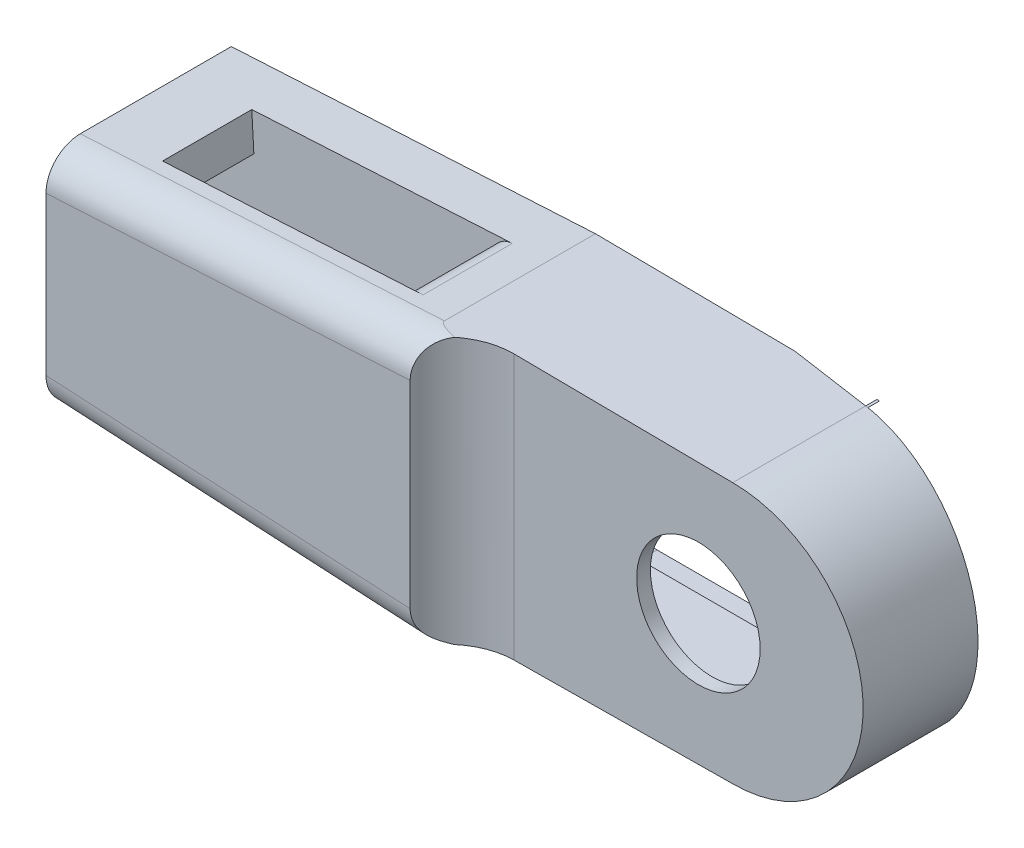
ISO-10303-21;
HEADER;
FILE_DESCRIPTION(('STEP AP214'),'2;1');
FILE_NAME('part.step','',(''),(''),'','','');
FILE_SCHEMA(('AUTOMOTIVE_DESIGN { 1 0 10303 214 1 1 1 1 }'));
ENDSEC;
DATA;
#1=APPLICATION_CONTEXT('core data for automotive mechanical design processes');
#2=APPLICATION_PROTOCOL_DEFINITION('international standard','automotive_design',2000,#1);
#3=PRODUCT_CONTEXT('',#1,'mechanical');
#4=PRODUCT('Part','Part','',(#3));
#5=PRODUCT_RELATED_PRODUCT_CATEGORY('part','',(#4));
#6=PRODUCT_DEFINITION_FORMATION('','',#4);
#7=PRODUCT_DEFINITION_CONTEXT('part definition',#1,'design');
#8=PRODUCT_DEFINITION('design','',#6,#7);
#9=PRODUCT_DEFINITION_SHAPE('','',#8);
#10=(LENGTH_UNIT() NAMED_UNIT(*) SI_UNIT(.MILLI.,.METRE.));
#11=(NAMED_UNIT(*) PLANE_ANGLE_UNIT() SI_UNIT($,.RADIAN.));
#12=(NAMED_UNIT(*) SI_UNIT($,.STERADIAN.) SOLID_ANGLE_UNIT());
#13=UNCERTAINTY_MEASURE_WITH_UNIT(LENGTH_MEASURE(1.E-05),#10,'distance_accuracy_value','');
#14=(GEOMETRIC_REPRESENTATION_CONTEXT(3) GLOBAL_UNCERTAINTY_ASSIGNED_CONTEXT((#13)) GLOBAL_UNIT_ASSIGNED_CONTEXT((#10,
#11,#12)) REPRESENTATION_CONTEXT('',''));
#15=CARTESIAN_POINT('',(0.,0.,0.));
#16=DIRECTION('',(0.,0.,1.));
#17=DIRECTION('',(1.,0.,0.));
#18=AXIS2_PLACEMENT_3D('',#15,#16,#17);
#19=CARTESIAN_POINT('',(36.,0.,-27.));
#20=DIRECTION('',(0.,0.,1.));
#21=DIRECTION('',(1.,0.,0.));
#22=AXIS2_PLACEMENT_3D('',#19,#20,#21);
#23=CYLINDRICAL_SURFACE('',#22,9.);
#24=CARTESIAN_POINT('',(36.,0.,-6.));
#25=DIRECTION('',(0.,0.,1.));
#26=DIRECTION('',(1.,0.,0.));
#27=AXIS2_PLACEMENT_3D('',#24,#25,#26);
#28=CIRCLE('',#27,9.);
#29=CARTESIAN_POINT('',(45.,0.,-6.));
#30=VERTEX_POINT('',#29);
#31=EDGE_CURVE('E316',#30,#30,#28,.F.);
#32=ORIENTED_EDGE('',*,*,#31,.F.);
#33=EDGE_LOOP('',(#32));
#34=FACE_BOUND('',#33,.T.);
#35=CARTESIAN_POINT('',(36.,0.,-8.));
#36=DIRECTION('',(0.,0.,-1.));
#37=DIRECTION('',(-1.,0.,0.));
#38=AXIS2_PLACEMENT_3D('',#35,#36,#37);
#39=CIRCLE('',#38,9.);
#40=CARTESIAN_POINT('',(27.,0.,-8.));
#41=VERTEX_POINT('',#40);
#42=EDGE_CURVE('E559',#41,#41,#39,.F.);
#43=ORIENTED_EDGE('',*,*,#42,.F.);
#44=EDGE_LOOP('',(#43));
#45=FACE_BOUND('',#44,.T.);
#46=ADVANCED_FACE('F45',(#34,#45),#23,.F.);
#47=CARTESIAN_POINT('',(-38.5737420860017,-64.8291949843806,-7.));
#48=DIRECTION('',(-0.998498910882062,-0.0547715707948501,0.));
#49=DIRECTION('',(0.0547715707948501,-0.998498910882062,0.));
#50=AXIS2_PLACEMENT_3D('',#47,#48,#49);
#51=PLANE('',#50);
#52=DIRECTION('',(-0.0547715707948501,0.998498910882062,0.));
#53=VECTOR('',#52,1.);
#54=CARTESIAN_POINT('',(-38.5737420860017,-64.8291949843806,-7.));
#55=LINE('',#54,#53);
#56=CARTESIAN_POINT('',(-42.7665058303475,11.6058966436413,-7.));
#57=VERTEX_POINT('',#56);
#58=CARTESIAN_POINT('',(-43.0650108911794,17.0477157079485,-7.));
#59=VERTEX_POINT('',#58);
#60=EDGE_CURVE('E706',#57,#59,#55,.T.);
#61=ORIENTED_EDGE('',*,*,#60,.F.);
#62=DIRECTION('',(0.,0.,1.));
#63=VECTOR('',#62,1.);
#64=CARTESIAN_POINT('',(-42.7665058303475,11.6058966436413,-7.));
#65=LINE('',#64,#63);
#66=CARTESIAN_POINT('',(-42.7665058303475,11.6058966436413,-20.));
#67=VERTEX_POINT('',#66);
#68=EDGE_CURVE('E680',#67,#57,#65,.T.);
#69=ORIENTED_EDGE('',*,*,#68,.F.);
#70=DIRECTION('',(-0.0547715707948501,0.998498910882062,0.));
#71=VECTOR('',#70,1.);
#72=CARTESIAN_POINT('',(-38.5737420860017,-64.8291949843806,-20.));
#73=LINE('',#72,#71);
#74=CARTESIAN_POINT('',(-43.0650108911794,17.0477157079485,-20.));
#75=VERTEX_POINT('',#74);
#76=EDGE_CURVE('E711',#67,#75,#73,.T.);
#77=ORIENTED_EDGE('',*,*,#76,.T.);
#78=DIRECTION('',(0.,0.,1.));
#79=VECTOR('',#78,1.);
#80=CARTESIAN_POINT('',(-43.0650108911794,17.0477157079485,-7.));
#81=LINE('',#80,#79);
#82=EDGE_CURVE('E687',#75,#59,#81,.T.);
#83=ORIENTED_EDGE('',*,*,#82,.T.);
#84=EDGE_LOOP('',(#61,#69,#77,#83));
#85=FACE_BOUND('',#84,.T.);
#86=ADVANCED_FACE('F470',(#85),#51,.F.);
#87=CARTESIAN_POINT('',(0.,19.41,-27.));
#88=DIRECTION('',(0.00999950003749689,0.999950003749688,0.));
#89=DIRECTION('',(-0.999950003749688,0.00999950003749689,0.));
#90=AXIS2_PLACEMENT_3D('',#87,#88,#89);
#91=PLANE('',#90);
#92=DIRECTION('',(0.99070275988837,-0.00990702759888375,0.135683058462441));
#93=VECTOR('',#92,1.);
#94=CARTESIAN_POINT('',(29.0640159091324,19.1193598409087,-27.));
#95=LINE('',#94,#93);
#96=CARTESIAN_POINT('',(29.0640159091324,19.1193598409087,-27.));
#97=VERTEX_POINT('',#96);
#98=CARTESIAN_POINT('',(40.9999999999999,19.,-25.3652908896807));
#99=VERTEX_POINT('',#98);
#100=EDGE_CURVE('E272',#97,#99,#95,.T.);
#101=ORIENTED_EDGE('',*,*,#100,.F.);
#102=DIRECTION('',(-0.999950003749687,0.00999950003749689,0.));
#103=VECTOR('',#102,1.);
#104=CARTESIAN_POINT('',(0.,19.41,-27.));
#105=LINE('',#104,#103);
#106=CARTESIAN_POINT('',(0.,19.41,-27.));
#107=VERTEX_POINT('',#106);
#108=EDGE_CURVE('E285',#97,#107,#105,.T.);
#109=ORIENTED_EDGE('',*,*,#108,.T.);
#110=DIRECTION('',(0.,0.,1.));
#111=VECTOR('',#110,1.);
#112=CARTESIAN_POINT('',(0.,19.41,-27.));
#113=LINE('',#112,#111);
#114=CARTESIAN_POINT('',(0.,19.41,-5.));
#115=VERTEX_POINT('',#114);
#116=EDGE_CURVE('E317',#107,#115,#113,.T.);
#117=ORIENTED_EDGE('',*,*,#116,.T.);
#118=CARTESIAN_POINT('',(77.2122547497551,18.6378774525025,-5.));
#119=DIRECTION('',(0.00999950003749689,0.999950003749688,0.));
#120=DIRECTION('',(-0.999950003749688,0.00999950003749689,0.));
#121=AXIS2_PLACEMENT_3D('',#118,#119,#120);
#122=ELLIPSE('',#121,77.216115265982,5.);
#123=CARTESIAN_POINT('',(2.75593846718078,19.3824406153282,-3.6760660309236));
#124=VERTEX_POINT('',#123);
#125=EDGE_CURVE('E580',#115,#124,#122,.T.);
#126=ORIENTED_EDGE('',*,*,#125,.T.);
#127=CARTESIAN_POINT('',(9.16515138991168,19.3183484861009,4.));
#128=DIRECTION('',(0.00999950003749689,0.999950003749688,0.));
#129=DIRECTION('',(-0.999950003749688,0.00999950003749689,0.));
#130=AXIS2_PLACEMENT_3D('',#127,#128,#129);
#131=ELLIPSE('',#130,10.0004999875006,10.);
#132=CARTESIAN_POINT('',(9.16515138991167,19.3183484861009,-6.));
#133=VERTEX_POINT('',#132);
#134=EDGE_CURVE('E598',#124,#133,#131,.F.);
#135=ORIENTED_EDGE('',*,*,#134,.T.);
#136=DIRECTION('',(-0.999950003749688,0.00999950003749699,0.));
#137=VECTOR('',#136,1.);
#138=CARTESIAN_POINT('',(40.9999999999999,19.,-6.));
#139=LINE('',#138,#137);
#140=CARTESIAN_POINT('',(40.9999999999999,19.,-6.));
#141=VERTEX_POINT('',#140);
#142=EDGE_CURVE('E727',#141,#133,#139,.T.);
#143=ORIENTED_EDGE('',*,*,#142,.F.);
#144=DIRECTION('',(0.,0.,1.));
#145=VECTOR('',#144,1.);
#146=CARTESIAN_POINT('',(41.,19.,-27.));
#147=LINE('',#146,#145);
#148=EDGE_CURVE('E288',#99,#141,#147,.T.);
#149=ORIENTED_EDGE('',*,*,#148,.F.);
#150=EDGE_LOOP('',(#101,#109,#117,#126,#135,#143,#149));
#151=FACE_BOUND('',#150,.T.);
#152=ADVANCED_FACE('F283',(#151),#91,.T.);
#153=CARTESIAN_POINT('',(41.,0.,-27.));
#154=DIRECTION('',(0.,0.,1.));
#155=DIRECTION('',(1.,0.,0.));
#156=AXIS2_PLACEMENT_3D('',#153,#154,#155);
#157=CYLINDRICAL_SURFACE('',#156,19.);
#158=CARTESIAN_POINT('',(41.,0.,-25.3392717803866));
#159=DIRECTION('',(-0.135676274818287,0.00135676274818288,0.990752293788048));
#160=DIRECTION('',(0.99070275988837,-0.00990702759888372,0.135683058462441));
#161=AXIS2_PLACEMENT_3D('',#158,#159,#160);
#162=ELLIPSE('',#161,19.1773464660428,19.);
#163=CARTESIAN_POINT('',(41.3799620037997,18.996200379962,-25.3132526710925));
#164=VERTEX_POINT('',#163);
#165=CARTESIAN_POINT('',(41.0000000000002,-19.,-25.3132526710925));
#166=VERTEX_POINT('',#165);
#167=EDGE_CURVE('E903',#164,#166,#162,.F.);
#168=ORIENTED_EDGE('',*,*,#167,.F.);
#169=DIRECTION('',(0.,0.,1.));
#170=VECTOR('',#169,1.);
#171=CARTESIAN_POINT('',(41.3799620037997,18.996200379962,-27.));
#172=LINE('',#171,#170);
#173=CARTESIAN_POINT('',(41.3799620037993,18.996200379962,-27.));
#174=VERTEX_POINT('',#173);
#175=EDGE_CURVE('E335',#164,#174,#172,.F.);
#176=ORIENTED_EDGE('',*,*,#175,.T.);
#177=CARTESIAN_POINT('',(41.,0.,-27.));
#178=DIRECTION('',(0.,0.,1.));
#179=DIRECTION('',(0.019998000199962,0.999800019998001,0.));
#180=AXIS2_PLACEMENT_3D('',#177,#178,#179);
#181=CIRCLE('',#180,19.);
#182=CARTESIAN_POINT('',(41.,19.,-27.));
#183=VERTEX_POINT('',#182);
#184=EDGE_CURVE('E11',#174,#183,#181,.T.);
#185=ORIENTED_EDGE('',*,*,#184,.T.);
#186=EDGE_CURVE('E321',#183,#99,#147,.T.);
#187=ORIENTED_EDGE('',*,*,#186,.T.);
#188=ORIENTED_EDGE('',*,*,#148,.T.);
#189=CARTESIAN_POINT('',(41.,0.,-6.));
#190=DIRECTION('',(0.,0.,1.));
#191=DIRECTION('',(1.,0.,0.));
#192=AXIS2_PLACEMENT_3D('',#189,#190,#191);
#193=CIRCLE('',#192,19.);
#194=CARTESIAN_POINT('',(41.0000000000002,-19.,-6.));
#195=VERTEX_POINT('',#194);
#196=EDGE_CURVE('E723',#195,#141,#193,.T.);
#197=ORIENTED_EDGE('',*,*,#196,.F.);
#198=DIRECTION('',(0.,0.,1.));
#199=VECTOR('',#198,1.);
#200=CARTESIAN_POINT('',(41.,-19.,-27.));
#201=LINE('',#200,#199);
#202=EDGE_CURVE('E325',#166,#195,#201,.T.);
#203=ORIENTED_EDGE('',*,*,#202,.F.);
#204=EDGE_LOOP('',(#168,#176,#185,#187,#188,#197,#203));
#205=FACE_BOUND('',#204,.T.);
#206=ADVANCED_FACE('F334',(#205),#157,.T.);
#207=CARTESIAN_POINT('',(0.,-19.41,-27.));
#208=DIRECTION('',(0.00999950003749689,-0.999950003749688,0.));
#209=DIRECTION('',(0.999950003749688,0.00999950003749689,0.));
#210=AXIS2_PLACEMENT_3D('',#207,#208,#209);
#211=PLANE('',#210);
#212=DIRECTION('',(-0.990706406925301,-0.00990706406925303,-0.135656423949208));
#213=VECTOR('',#212,1.);
#214=CARTESIAN_POINT('',(0.527817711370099,-19.4047218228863,-30.8550675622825));
#215=LINE('',#214,#213);
#216=CARTESIAN_POINT('',(28.6815904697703,-19.1231840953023,-27.));
#217=VERTEX_POINT('',#216);
#218=EDGE_CURVE('E905',#166,#217,#215,.T.);
#219=ORIENTED_EDGE('',*,*,#218,.F.);
#220=ORIENTED_EDGE('',*,*,#202,.T.);
#221=DIRECTION('',(0.999950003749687,0.00999950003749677,0.));
#222=VECTOR('',#221,1.);
#223=CARTESIAN_POINT('',(-6.24458709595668E-13,-19.41,-6.));
#224=LINE('',#223,#222);
#225=CARTESIAN_POINT('',(9.16515138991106,-19.3183484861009,-6.));
#226=VERTEX_POINT('',#225);
#227=EDGE_CURVE('E596',#226,#195,#224,.T.);
#228=ORIENTED_EDGE('',*,*,#227,.F.);
#229=CARTESIAN_POINT('',(9.16515138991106,-19.3183484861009,4.));
#230=DIRECTION('',(0.00999950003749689,-0.999950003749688,0.));
#231=DIRECTION('',(0.999950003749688,0.00999950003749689,0.));
#232=AXIS2_PLACEMENT_3D('',#229,#230,#231);
#233=ELLIPSE('',#232,10.0004999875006,10.);
#234=CARTESIAN_POINT('',(2.75593846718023,-19.3824406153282,-3.67606603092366));
#235=VERTEX_POINT('',#234);
#236=EDGE_CURVE('E587',#226,#235,#233,.F.);
#237=ORIENTED_EDGE('',*,*,#236,.T.);
#238=CARTESIAN_POINT('',(77.2122547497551,-18.6378774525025,-5.));
#239=DIRECTION('',(0.00999950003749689,-0.999950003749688,0.));
#240=DIRECTION('',(0.999950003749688,0.00999950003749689,0.));
#241=AXIS2_PLACEMENT_3D('',#238,#239,#240);
#242=ELLIPSE('',#241,77.216115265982,5.);
#243=CARTESIAN_POINT('',(0.,-19.41,-5.));
#244=VERTEX_POINT('',#243);
#245=EDGE_CURVE('E73',#235,#244,#242,.T.);
#246=ORIENTED_EDGE('',*,*,#245,.T.);
#247=DIRECTION('',(0.,0.,1.));
#248=VECTOR('',#247,1.);
#249=CARTESIAN_POINT('',(0.,-19.41,-27.));
#250=LINE('',#249,#248);
#251=CARTESIAN_POINT('',(0.,-19.41,-27.));
#252=VERTEX_POINT('',#251);
#253=EDGE_CURVE('E743',#252,#244,#250,.T.);
#254=ORIENTED_EDGE('',*,*,#253,.F.);
#255=DIRECTION('',(0.999950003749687,0.00999950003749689,0.));
#256=VECTOR('',#255,1.);
#257=CARTESIAN_POINT('',(0.,-19.41,-27.));
#258=LINE('',#257,#256);
#259=EDGE_CURVE('E300',#252,#217,#258,.T.);
#260=ORIENTED_EDGE('',*,*,#259,.T.);
#261=EDGE_LOOP('',(#219,#220,#228,#237,#246,#254,#260));
#262=FACE_BOUND('',#261,.T.);
#263=ADVANCED_FACE('F489',(#262),#211,.T.);
#264=CARTESIAN_POINT('',(-53.05,16.5,-27.));
#265=DIRECTION('',(-0.0547715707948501,0.998498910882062,0.));
#266=DIRECTION('',(-0.998498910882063,-0.0547715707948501,0.));
#267=AXIS2_PLACEMENT_3D('',#264,#265,#266);
#268=PLANE('',#267);
#269=DIRECTION('',(-0.998498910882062,-0.0547715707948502,0.));
#270=VECTOR('',#269,1.);
#271=CARTESIAN_POINT('',(-43.0650108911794,17.0477157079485,-20.));
#272=LINE('',#271,#270);
#273=CARTESIAN_POINT('',(-5.12205227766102,19.1290353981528,-20.));
#274=VERTEX_POINT('',#273);
#275=EDGE_CURVE('E702',#274,#75,#272,.T.);
#276=ORIENTED_EDGE('',*,*,#275,.F.);
#277=DIRECTION('',(0.,0.,-1.));
#278=VECTOR('',#277,1.);
#279=CARTESIAN_POINT('',(-5.12205227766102,19.1290353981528,-7.));
#280=LINE('',#279,#278);
#281=CARTESIAN_POINT('',(-5.12205227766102,19.1290353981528,-7.));
#282=VERTEX_POINT('',#281);
#283=EDGE_CURVE('E538',#274,#282,#280,.F.);
#284=ORIENTED_EDGE('',*,*,#283,.T.);
#285=DIRECTION('',(0.998498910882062,0.0547715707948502,0.));
#286=VECTOR('',#285,1.);
#287=CARTESIAN_POINT('',(-43.0650108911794,17.0477157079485,-7.));
#288=LINE('',#287,#286);
#289=EDGE_CURVE('E699',#59,#282,#288,.T.);
#290=ORIENTED_EDGE('',*,*,#289,.F.);
#291=ORIENTED_EDGE('',*,*,#82,.F.);
#292=EDGE_LOOP('',(#276,#284,#290,#291));
#293=FACE_BOUND('',#292,.T.);
#294=DIRECTION('',(0.,0.,1.));
#295=VECTOR('',#294,1.);
#296=CARTESIAN_POINT('',(-53.05,16.5,-27.));
#297=LINE('',#296,#295);
#298=CARTESIAN_POINT('',(-53.05,16.5,-27.));
#299=VERTEX_POINT('',#298);
#300=CARTESIAN_POINT('',(-53.05,16.5,-5.));
#301=VERTEX_POINT('',#300);
#302=EDGE_CURVE('E299',#299,#301,#297,.T.);
#303=ORIENTED_EDGE('',*,*,#302,.T.);
#304=DIRECTION('',(-0.998498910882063,-0.0547715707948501,0.));
#305=VECTOR('',#304,1.);
#306=CARTESIAN_POINT('',(-53.05,16.5,-5.));
#307=LINE('',#306,#305);
#308=EDGE_CURVE('E578',#301,#115,#307,.F.);
#309=ORIENTED_EDGE('',*,*,#308,.T.);
#310=ORIENTED_EDGE('',*,*,#116,.F.);
#311=DIRECTION('',(-0.998498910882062,-0.0547715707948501,0.));
#312=VECTOR('',#311,1.);
#313=CARTESIAN_POINT('',(-53.05,16.5,-27.));
#314=LINE('',#313,#312);
#315=EDGE_CURVE('E297',#107,#299,#314,.T.);
#316=ORIENTED_EDGE('',*,*,#315,.T.);
#317=EDGE_LOOP('',(#303,#309,#310,#316));
#318=FACE_BOUND('',#317,.T.);
#319=ADVANCED_FACE('F492',(#293,#318),#268,.T.);
#320=CARTESIAN_POINT('',(-53.05,-16.5,-27.));
#321=DIRECTION('',(-0.0547715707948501,-0.998498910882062,0.));
#322=DIRECTION('',(0.998498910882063,-0.0547715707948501,0.));
#323=AXIS2_PLACEMENT_3D('',#320,#321,#322);
#324=PLANE('',#323);
#325=DIRECTION('',(-0.998498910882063,0.0547715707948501,0.));
#326=VECTOR('',#325,1.);
#327=CARTESIAN_POINT('',(-53.05,-16.5,-7.));
#328=LINE('',#327,#326);
#329=CARTESIAN_POINT('',(-3.34673503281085,-19.2264184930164,-7.));
#330=VERTEX_POINT('',#329);
#331=CARTESIAN_POINT('',(-41.1890985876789,-17.150616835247,-7.));
#332=VERTEX_POINT('',#331);
#333=EDGE_CURVE('E751',#330,#332,#328,.T.);
#334=ORIENTED_EDGE('',*,*,#333,.F.);
#335=DIRECTION('',(0.,0.,1.));
#336=VECTOR('',#335,1.);
#337=CARTESIAN_POINT('',(-3.34673503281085,-19.2264184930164,-20.));
#338=LINE('',#337,#336);
#339=CARTESIAN_POINT('',(-3.34673503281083,-19.2264184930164,-20.));
#340=VERTEX_POINT('',#339);
#341=EDGE_CURVE('E769',#330,#340,#338,.F.);
#342=ORIENTED_EDGE('',*,*,#341,.T.);
#343=DIRECTION('',(0.998498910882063,-0.0547715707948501,0.));
#344=VECTOR('',#343,1.);
#345=CARTESIAN_POINT('',(-53.05,-16.5,-20.));
#346=LINE('',#345,#344);
#347=CARTESIAN_POINT('',(-41.1890985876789,-17.150616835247,-20.));
#348=VERTEX_POINT('',#347);
#349=EDGE_CURVE('E754',#348,#340,#346,.T.);
#350=ORIENTED_EDGE('',*,*,#349,.F.);
#351=DIRECTION('',(0.,0.,-1.));
#352=VECTOR('',#351,1.);
#353=CARTESIAN_POINT('',(-41.1890985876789,-17.150616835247,-27.));
#354=LINE('',#353,#352);
#355=EDGE_CURVE('E760',#332,#348,#354,.T.);
#356=ORIENTED_EDGE('',*,*,#355,.F.);
#357=EDGE_LOOP('',(#334,#342,#350,#356));
#358=FACE_BOUND('',#357,.T.);
#359=ORIENTED_EDGE('',*,*,#253,.T.);
#360=DIRECTION('',(0.998498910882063,-0.0547715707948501,0.));
#361=VECTOR('',#360,1.);
#362=CARTESIAN_POINT('',(-53.05,-16.5,-5.));
#363=LINE('',#362,#361);
#364=CARTESIAN_POINT('',(-53.05,-16.5,-5.));
#365=VERTEX_POINT('',#364);
#366=EDGE_CURVE('E602',#244,#365,#363,.F.);
#367=ORIENTED_EDGE('',*,*,#366,.T.);
#368=DIRECTION('',(0.,0.,1.));
#369=VECTOR('',#368,1.);
#370=CARTESIAN_POINT('',(-53.05,-16.5,-27.));
#371=LINE('',#370,#369);
#372=CARTESIAN_POINT('',(-53.05,-16.5,-27.));
#373=VERTEX_POINT('',#372);
#374=EDGE_CURVE('E305',#373,#365,#371,.T.);
#375=ORIENTED_EDGE('',*,*,#374,.F.);
#376=DIRECTION('',(0.998498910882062,-0.0547715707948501,0.));
#377=VECTOR('',#376,1.);
#378=CARTESIAN_POINT('',(-53.05,-16.5,-27.));
#379=LINE('',#378,#377);
#380=EDGE_CURVE('E308',#373,#252,#379,.T.);
#381=ORIENTED_EDGE('',*,*,#380,.T.);
#382=EDGE_LOOP('',(#359,#367,#375,#381));
#383=FACE_BOUND('',#382,.T.);
#384=ADVANCED_FACE('F493',(#358,#383),#324,.T.);
#385=CARTESIAN_POINT('',(-53.05,16.5,-27.));
#386=DIRECTION('',(-1.,0.,0.));
#387=DIRECTION('',(0.,0.,1.));
#388=AXIS2_PLACEMENT_3D('',#385,#386,#387);
#389=PLANE('',#388);
#390=CARTESIAN_POINT('',(-53.05,0.,-13.4));
#391=DIRECTION('',(-1.,0.,0.));
#392=DIRECTION('',(0.,0.,1.));
#393=AXIS2_PLACEMENT_3D('',#390,#391,#392);
#394=CIRCLE('',#393,6.44999999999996);
#395=CARTESIAN_POINT('',(-53.05,0.,-6.95000000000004));
#396=VERTEX_POINT('',#395);
#397=EDGE_CURVE('E634',#396,#396,#394,.T.);
#398=ORIENTED_EDGE('',*,*,#397,.F.);
#399=EDGE_LOOP('',(#398));
#400=FACE_BOUND('',#399,.T.);
#401=DIRECTION('',(0.,-1.,0.));
#402=VECTOR('',#401,1.);
#403=CARTESIAN_POINT('',(-53.05,16.5,0.));
#404=LINE('',#403,#402);
#405=CARTESIAN_POINT('',(-53.05,11.4924832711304,0.));
#406=VERTEX_POINT('',#405);
#407=CARTESIAN_POINT('',(-53.05,-11.4924832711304,0.));
#408=VERTEX_POINT('',#407);
#409=EDGE_CURVE('E312',#406,#408,#404,.T.);
#410=ORIENTED_EDGE('',*,*,#409,.F.);
#411=CARTESIAN_POINT('',(-53.05,11.4924832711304,-5.));
#412=DIRECTION('',(-1.,0.,0.));
#413=DIRECTION('',(0.,-1.,0.));
#414=AXIS2_PLACEMENT_3D('',#411,#412,#413);
#415=ELLIPSE('',#414,5.0075167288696,5.);
#416=EDGE_CURVE('E575',#406,#301,#415,.T.);
#417=ORIENTED_EDGE('',*,*,#416,.T.);
#418=ORIENTED_EDGE('',*,*,#302,.F.);
#419=DIRECTION('',(0.,-1.,0.));
#420=VECTOR('',#419,1.);
#421=CARTESIAN_POINT('',(-53.05,16.5,-27.));
#422=LINE('',#421,#420);
#423=EDGE_CURVE('E737',#299,#373,#422,.T.);
#424=ORIENTED_EDGE('',*,*,#423,.T.);
#425=ORIENTED_EDGE('',*,*,#374,.T.);
#426=CARTESIAN_POINT('',(-53.05,-11.4924832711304,-5.));
#427=DIRECTION('',(-1.,0.,0.));
#428=DIRECTION('',(0.,-1.,0.));
#429=AXIS2_PLACEMENT_3D('',#426,#427,#428);
#430=ELLIPSE('',#429,5.0075167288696,5.);
#431=EDGE_CURVE('E572',#365,#408,#430,.T.);
#432=ORIENTED_EDGE('',*,*,#431,.T.);
#433=EDGE_LOOP('',(#410,#417,#418,#424,#425,#432));
#434=FACE_BOUND('',#433,.T.);
#435=ADVANCED_FACE('F481',(#400,#434),#389,.T.);
#436=CARTESIAN_POINT('',(41.,0.,-27.));
#437=DIRECTION('',(0.,0.,1.));
#438=DIRECTION('',(1.,0.,0.));
#439=AXIS2_PLACEMENT_3D('',#436,#437,#438);
#440=PLANE('',#439);
#441=ORIENTED_EDGE('',*,*,#108,.F.);
#442=DIRECTION('',(0.00999950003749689,0.999950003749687,0.));
#443=VECTOR('',#442,1.);
#444=CARTESIAN_POINT('',(28.67403540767,-19.8786903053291,-27.));
#445=LINE('',#444,#443);
#446=CARTESIAN_POINT('',(29.0328223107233,16.,-27.));
#447=VERTEX_POINT('',#446);
#448=EDGE_CURVE('E268',#447,#97,#445,.T.);
#449=ORIENTED_EDGE('',*,*,#448,.F.);
#450=DIRECTION('',(1.,0.,0.));
#451=VECTOR('',#450,1.);
#452=CARTESIAN_POINT('',(40.,16.,-27.));
#453=LINE('',#452,#451);
#454=CARTESIAN_POINT('',(8.99999999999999,16.,-27.));
#455=VERTEX_POINT('',#454);
#456=EDGE_CURVE('E621',#455,#447,#453,.T.);
#457=ORIENTED_EDGE('',*,*,#456,.F.);
#458=CARTESIAN_POINT('',(8.99999999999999,0.,-27.));
#459=DIRECTION('',(0.,0.,-1.));
#460=DIRECTION('',(-1.,0.,0.));
#461=AXIS2_PLACEMENT_3D('',#458,#459,#460);
#462=CIRCLE('',#461,16.);
#463=CARTESIAN_POINT('',(9.,-16.,-27.));
#464=VERTEX_POINT('',#463);
#465=EDGE_CURVE('E617',#464,#455,#462,.T.);
#466=ORIENTED_EDGE('',*,*,#465,.F.);
#467=DIRECTION('',(-1.,0.,0.));
#468=VECTOR('',#467,1.);
#469=CARTESIAN_POINT('',(40.,-16.,-27.));
#470=LINE('',#469,#468);
#471=CARTESIAN_POINT('',(28.7128223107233,-16.,-27.));
#472=VERTEX_POINT('',#471);
#473=EDGE_CURVE('E563',#472,#464,#470,.T.);
#474=ORIENTED_EDGE('',*,*,#473,.F.);
#475=EDGE_CURVE('E65',#217,#472,#445,.T.);
#476=ORIENTED_EDGE('',*,*,#475,.F.);
#477=ORIENTED_EDGE('',*,*,#259,.F.);
#478=ORIENTED_EDGE('',*,*,#380,.F.);
#479=ORIENTED_EDGE('',*,*,#423,.F.);
#480=ORIENTED_EDGE('',*,*,#315,.F.);
#481=EDGE_LOOP('',(#441,#449,#457,#466,#474,#476,#477,#478,#479,#480));
#482=FACE_BOUND('',#481,.T.);
#483=ADVANCED_FACE('F294',(#482),#440,.F.);
#484=CARTESIAN_POINT('',(41.,0.,0.));
#485=DIRECTION('',(0.,0.,1.));
#486=DIRECTION('',(1.,0.,0.));
#487=AXIS2_PLACEMENT_3D('',#484,#485,#486);
#488=PLANE('',#487);
#489=DIRECTION('',(0.,-1.,0.));
#490=VECTOR('',#489,1.);
#491=CARTESIAN_POINT('',(0.,19.41,0.));
#492=LINE('',#491,#490);
#493=CARTESIAN_POINT('',(0.,14.4024832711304,0.));
#494=VERTEX_POINT('',#493);
#495=CARTESIAN_POINT('',(-5.43907771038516E-13,-14.4024832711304,0.));
#496=VERTEX_POINT('',#495);
#497=EDGE_CURVE('E590',#494,#496,#492,.T.);
#498=ORIENTED_EDGE('',*,*,#497,.F.);
#499=DIRECTION('',(-0.998498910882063,-0.0547715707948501,0.));
#500=VECTOR('',#499,1.);
#501=CARTESIAN_POINT('',(40.0893405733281,16.601540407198,0.));
#502=LINE('',#501,#500);
#503=EDGE_CURVE('E568',#494,#406,#502,.T.);
#504=ORIENTED_EDGE('',*,*,#503,.T.);
#505=ORIENTED_EDGE('',*,*,#409,.T.);
#506=DIRECTION('',(0.998498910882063,-0.0547715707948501,0.));
#507=VECTOR('',#506,1.);
#508=CARTESIAN_POINT('',(40.0893405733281,-16.601540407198,0.));
#509=LINE('',#508,#507);
#510=EDGE_CURVE('E558',#408,#496,#509,.T.);
#511=ORIENTED_EDGE('',*,*,#510,.T.);
#512=EDGE_LOOP('',(#498,#504,#505,#511));
#513=FACE_BOUND('',#512,.T.);
#514=ADVANCED_FACE('F474',(#513),#488,.T.);
#515=CARTESIAN_POINT('',(41.,0.,-6.));
#516=DIRECTION('',(0.,0.,1.));
#517=DIRECTION('',(1.,0.,0.));
#518=AXIS2_PLACEMENT_3D('',#515,#516,#517);
#519=PLANE('',#518);
#520=ORIENTED_EDGE('',*,*,#142,.T.);
#521=DIRECTION('',(0.,-1.,0.));
#522=VECTOR('',#521,1.);
#523=CARTESIAN_POINT('',(9.16515138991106,-19.4100000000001,-6.));
#524=LINE('',#523,#522);
#525=EDGE_CURVE('E320',#133,#226,#524,.T.);
#526=ORIENTED_EDGE('',*,*,#525,.T.);
#527=ORIENTED_EDGE('',*,*,#227,.T.);
#528=ORIENTED_EDGE('',*,*,#196,.T.);
#529=EDGE_LOOP('',(#520,#526,#527,#528));
#530=FACE_BOUND('',#529,.T.);
#531=ORIENTED_EDGE('',*,*,#31,.T.);
#532=EDGE_LOOP('',(#531));
#533=FACE_BOUND('',#532,.T.);
#534=ADVANCED_FACE('F471',(#530,#533),#519,.T.);
#535=CARTESIAN_POINT('',(9.16515138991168,19.4099999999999,4.));
#536=DIRECTION('',(0.,1.,0.));
#537=DIRECTION('',(-1.,0.,0.));
#538=AXIS2_PLACEMENT_3D('',#535,#536,#537);
#539=CYLINDRICAL_SURFACE('',#538,10.);
#540=ORIENTED_EDGE('',*,*,#134,.F.);
#541=CARTESIAN_POINT('',(2.75593846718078,19.3824406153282,-3.6760660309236));
#542=CARTESIAN_POINT('',(2.62835323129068,19.3461627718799,-3.56958659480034));
#543=CARTESIAN_POINT('',(2.50414377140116,19.3055289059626,-3.46043248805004));
#544=CARTESIAN_POINT('',(2.26303788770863,19.2143619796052,-3.23792609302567));
#545=CARTESIAN_POINT('',(2.14615141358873,19.1638158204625,-3.12456841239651));
#546=CARTESIAN_POINT('',(1.92012582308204,19.0514938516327,-2.89461758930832));
#547=CARTESIAN_POINT('',(1.81102106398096,18.9896720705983,-2.7780129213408));
#548=CARTESIAN_POINT('',(1.60184781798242,18.8540244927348,-2.54377997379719));
#549=CARTESIAN_POINT('',(1.50177416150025,18.7802056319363,-2.42615232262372));
#550=CARTESIAN_POINT('',(1.32650441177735,18.6327458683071,-2.21061250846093));
#551=CARTESIAN_POINT('',(1.24989359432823,18.5609786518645,-2.11256663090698));
#552=CARTESIAN_POINT('',(1.10368461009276,18.408287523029,-1.91840472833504));
#553=CARTESIAN_POINT('',(1.03408527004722,18.3273651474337,-1.82228838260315));
#554=CARTESIAN_POINT('',(0.902225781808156,18.1565589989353,-1.63358501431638));
#555=CARTESIAN_POINT('',(0.839947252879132,18.0666987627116,-1.54098956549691));
#556=CARTESIAN_POINT('',(0.722574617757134,17.8780412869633,-1.36045636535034));
#557=CARTESIAN_POINT('',(0.667480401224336,17.7792441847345,-1.2725185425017));
#558=CARTESIAN_POINT('',(0.56419454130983,17.5726827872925,-1.10230320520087));
#559=CARTESIAN_POINT('',(0.516033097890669,17.4648823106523,-1.02005122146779));
#560=CARTESIAN_POINT('',(0.426720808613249,17.2412860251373,-0.862921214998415));
#561=CARTESIAN_POINT('',(0.385570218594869,17.1254899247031,-0.788043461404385));
#562=CARTESIAN_POINT('',(0.309977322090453,16.8865236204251,-0.646754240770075));
#563=CARTESIAN_POINT('',(0.275544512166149,16.7633432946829,-0.580354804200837));
#564=CARTESIAN_POINT('',(0.213158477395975,16.5106930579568,-0.457195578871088));
#565=CARTESIAN_POINT('',(0.185204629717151,16.3812237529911,-0.400434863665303));
#566=CARTESIAN_POINT('',(0.137126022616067,16.125897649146,-0.30088426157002));
#567=CARTESIAN_POINT('',(0.116601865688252,16.0003811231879,-0.257412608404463));
#568=CARTESIAN_POINT('',(0.0806727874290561,15.7456777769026,-0.180199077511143));
#569=CARTESIAN_POINT('',(0.0652676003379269,15.616491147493,-0.146456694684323));
#570=CARTESIAN_POINT('',(0.0394029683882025,15.3556883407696,-0.0892175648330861));
#571=CARTESIAN_POINT('',(0.0289327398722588,15.2240781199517,-0.0656984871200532));
#572=CARTESIAN_POINT('',(0.0127494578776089,14.9591801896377,-0.0291367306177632));
#573=CARTESIAN_POINT('',(0.0070334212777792,14.8258935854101,-0.016087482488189));
#574=CARTESIAN_POINT('',(0.00243718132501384,14.6440175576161,-0.00558024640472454));
#575=CARTESIAN_POINT('',(0.00152273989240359,14.5957086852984,-0.00348745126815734));
#576=CARTESIAN_POINT('',(0.000304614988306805,14.4990962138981,-0.000698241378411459));
#577=CARTESIAN_POINT('',(2.60052762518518E-07,14.4507926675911,-2.91454605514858E-07));
#578=CARTESIAN_POINT('',(-2.75366204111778E-13,14.4024832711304,0.));
#579=B_SPLINE_CURVE_WITH_KNOTS('',3,(#541,#542,#543,#544,#545,#546,#547,#548,#549,#550,#551,
#552,#553,#554,#555,#556,#557,#558,#559,#560,#561,#562,#563,#564,#565,#566,#567,#568,#569,#570,
#571,#572,#573,#574,#575,#576,#577,#578),.UNSPECIFIED.,.F.,.F.,(4,2,2,2,2,2,2,2,2,2,2,2,2,2,2,2,
2,2,4),(0.,0.510281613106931,1.02124214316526,1.53433444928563,2.0471311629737,2.47760969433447,
2.90801607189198,3.33731761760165,3.76661256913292,4.1977243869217,4.62885193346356,
5.06058459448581,5.49227573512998,5.89500830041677,6.2977199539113,6.69954749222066,
7.10112270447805,7.24619300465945,7.39110355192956),.UNSPECIFIED.);
#580=EDGE_CURVE('E517',#124,#494,#579,.T.);
#581=ORIENTED_EDGE('',*,*,#580,.T.);
#582=ORIENTED_EDGE('',*,*,#497,.T.);
#583=CARTESIAN_POINT('',(-5.4373314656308E-13,-14.4024832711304,0.));
#584=CARTESIAN_POINT('',(1.29761809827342E-05,-14.5338692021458,1.98082107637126E-05));
#585=CARTESIAN_POINT('',(0.00225357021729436,-14.6652481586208,-0.0051621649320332));
#586=CARTESIAN_POINT('',(0.0112588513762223,-14.9270331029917,-0.0257276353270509));
#587=CARTESIAN_POINT('',(0.0180229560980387,-15.057439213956,-0.0411098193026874));
#588=CARTESIAN_POINT('',(0.0361302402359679,-15.3161559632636,-0.0818426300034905));
#589=CARTESIAN_POINT('',(0.0474664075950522,-15.4444694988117,-0.107177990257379));
#590=CARTESIAN_POINT('',(0.0748691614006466,-15.6982982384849,-0.167477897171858));
#591=CARTESIAN_POINT('',(0.0909357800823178,-15.8238134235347,-0.202442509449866));
#592=CARTESIAN_POINT('',(0.12799883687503,-16.0711917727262,-0.281562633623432));
#593=CARTESIAN_POINT('',(0.148996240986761,-16.1930542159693,-0.325719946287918));
#594=CARTESIAN_POINT('',(0.196149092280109,-16.4322703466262,-0.422657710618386));
#595=CARTESIAN_POINT('',(0.222304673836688,-16.5496239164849,-0.475438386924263));
#596=CARTESIAN_POINT('',(0.280007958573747,-16.7790197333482,-0.588929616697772));
#597=CARTESIAN_POINT('',(0.311554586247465,-16.8910630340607,-0.649638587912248));
#598=CARTESIAN_POINT('',(0.380271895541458,-17.1091634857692,-0.778200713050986));
#599=CARTESIAN_POINT('',(0.417442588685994,-17.2152206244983,-0.846053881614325));
#600=CARTESIAN_POINT('',(0.498048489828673,-17.4218900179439,-0.988799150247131));
#601=CARTESIAN_POINT('',(0.541548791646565,-17.5224285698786,-1.06376116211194));
#602=CARTESIAN_POINT('',(0.634656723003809,-17.7163000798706,-1.21908606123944));
#603=CARTESIAN_POINT('',(0.68426641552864,-17.8096305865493,-1.29945076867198));
#604=CARTESIAN_POINT('',(0.789632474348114,-17.9886571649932,-1.46445409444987));
#605=CARTESIAN_POINT('',(0.845386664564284,-18.0743559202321,-1.54909119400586));
#606=CARTESIAN_POINT('',(0.963061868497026,-18.2379791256,-1.72159344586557));
#607=CARTESIAN_POINT('',(1.02498510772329,-18.3159007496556,-1.80945975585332));
#608=CARTESIAN_POINT('',(1.15802403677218,-18.4674637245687,-1.99159681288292));
#609=CARTESIAN_POINT('',(1.22943929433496,-18.5407164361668,-2.08597189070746));
#610=CARTESIAN_POINT('',(1.37874445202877,-18.6787364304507,-2.27586345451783));
#611=CARTESIAN_POINT('',(1.45663699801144,-18.743500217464,-2.37138039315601));
#612=CARTESIAN_POINT('',(1.6186203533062,-18.8648214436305,-2.56243532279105));
#613=CARTESIAN_POINT('',(1.70271362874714,-18.9213755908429,-2.65797330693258));
#614=CARTESIAN_POINT('',(1.87673799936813,-19.0266807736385,-2.84803980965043));
#615=CARTESIAN_POINT('',(1.96667000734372,-19.0754305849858,-2.94256816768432));
#616=CARTESIAN_POINT('',(2.16850371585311,-19.1736860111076,-3.14639367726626));
#617=CARTESIAN_POINT('',(2.28146483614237,-19.2217786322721,-3.25532129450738));
#618=CARTESIAN_POINT('',(2.5139093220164,-19.3087142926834,-3.46900233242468));
#619=CARTESIAN_POINT('',(2.63336915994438,-19.3475882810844,-3.57376870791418));
#620=CARTESIAN_POINT('',(2.75593846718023,-19.3824406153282,-3.67606603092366));
#621=B_SPLINE_CURVE_WITH_KNOTS('',3,(#583,#584,#585,#586,#587,#588,#589,#590,#591,#592,#593,
#594,#595,#596,#597,#598,#599,#600,#601,#602,#603,#604,#605,#606,#607,#608,#609,#610,#611,#612,
#613,#614,#615,#616,#617,#618,#619,#620),.UNSPECIFIED.,.F.,.F.,(4,2,2,2,2,2,2,2,2,2,2,2,2,2,2,2,
2,2,4),(0.,0.394026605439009,0.788002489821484,1.18137642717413,1.57475304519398,
1.96820679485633,2.36167079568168,2.75505639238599,3.148442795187,3.54620573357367,
3.94410335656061,4.34186051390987,4.73976168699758,5.15688551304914,5.57418057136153,
5.99164249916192,6.40916984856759,6.90109091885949,7.39133634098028),.UNSPECIFIED.);
#622=EDGE_CURVE('E510',#496,#235,#621,.T.);
#623=ORIENTED_EDGE('',*,*,#622,.T.);
#624=ORIENTED_EDGE('',*,*,#236,.F.);
#625=ORIENTED_EDGE('',*,*,#525,.F.);
#626=EDGE_LOOP('',(#540,#581,#582,#623,#624,#625));
#627=FACE_BOUND('',#626,.T.);
#628=ADVANCED_FACE('F468',(#627),#539,.F.);
#629=CARTESIAN_POINT('',(-41.5067597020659,-11.3595783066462,-20.));
#630=VERTEX_POINT('',#629);
#631=EDGE_CURVE('E707',#348,#630,#73,.T.);
#632=ORIENTED_EDGE('',*,*,#631,.T.);
#633=DIRECTION('',(0.,0.,-1.));
#634=VECTOR('',#633,1.);
#635=CARTESIAN_POINT('',(-41.5067597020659,-11.3595783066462,-7.));
#636=LINE('',#635,#634);
#637=CARTESIAN_POINT('',(-41.5067597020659,-11.3595783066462,-7.));
#638=VERTEX_POINT('',#637);
#639=EDGE_CURVE('E658',#638,#630,#636,.T.);
#640=ORIENTED_EDGE('',*,*,#639,.F.);
#641=EDGE_CURVE('E719',#332,#638,#55,.T.);
#642=ORIENTED_EDGE('',*,*,#641,.F.);
#643=ORIENTED_EDGE('',*,*,#355,.T.);
#644=EDGE_LOOP('',(#632,#640,#642,#643));
#645=FACE_BOUND('',#644,.T.);
#646=ADVANCED_FACE('F456',(#645),#51,.F.);
#647=CARTESIAN_POINT('',(-38.5737420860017,-64.8291949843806,-20.));
#648=DIRECTION('',(0.,0.,-1.));
#649=DIRECTION('',(-1.,0.,0.));
#650=AXIS2_PLACEMENT_3D('',#647,#648,#649);
#651=PLANE('',#650);
#652=ORIENTED_EDGE('',*,*,#349,.T.);
#653=CARTESIAN_POINT('',(-3.1824203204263,-16.2309217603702,-20.));
#654=DIRECTION('',(0.,0.,-1.));
#655=DIRECTION('',(-1.,0.,0.));
#656=AXIS2_PLACEMENT_3D('',#653,#654,#655);
#657=CIRCLE('',#656,3.);
#658=CARTESIAN_POINT('',(-6.17791705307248,-16.3952364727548,-20.));
#659=VERTEX_POINT('',#658);
#660=EDGE_CURVE('E552',#340,#659,#657,.T.);
#661=ORIENTED_EDGE('',*,*,#660,.T.);
#662=DIRECTION('',(-0.0547715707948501,0.998498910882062,0.));
#663=VECTOR('',#662,1.);
#664=CARTESIAN_POINT('',(-3.62628020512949,-62.9121900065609,-20.));
#665=LINE('',#664,#663);
#666=CARTESIAN_POINT('',(-7.95323429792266,15.9692239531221,-20.));
#667=VERTEX_POINT('',#666);
#668=EDGE_CURVE('E712',#659,#667,#665,.T.);
#669=ORIENTED_EDGE('',*,*,#668,.T.);
#670=CARTESIAN_POINT('',(-4.95773756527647,16.1335386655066,-20.));
#671=DIRECTION('',(0.,0.,-1.));
#672=DIRECTION('',(-1.,0.,0.));
#673=AXIS2_PLACEMENT_3D('',#670,#671,#672);
#674=CIRCLE('',#673,3.);
#675=EDGE_CURVE('E545',#667,#274,#674,.T.);
#676=ORIENTED_EDGE('',*,*,#675,.T.);
#677=ORIENTED_EDGE('',*,*,#275,.T.);
#678=ORIENTED_EDGE('',*,*,#76,.F.);
#679=DIRECTION('',(0.998498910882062,0.0547715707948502,0.));
#680=VECTOR('',#679,1.);
#681=CARTESIAN_POINT('',(-50.754497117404,11.1677240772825,-20.));
#682=LINE('',#681,#680);
#683=CARTESIAN_POINT('',(-50.754497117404,11.1677240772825,-20.));
#684=VERTEX_POINT('',#683);
#685=EDGE_CURVE('E688',#684,#67,#682,.T.);
#686=ORIENTED_EDGE('',*,*,#685,.F.);
#687=DIRECTION('',(-0.0547715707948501,0.998498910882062,0.));
#688=VECTOR('',#687,1.);
#689=CARTESIAN_POINT('',(-50.754497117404,11.1677240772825,-20.));
#690=LINE('',#689,#688);
#691=CARTESIAN_POINT('',(-49.4947509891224,-11.797750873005,-20.));
#692=VERTEX_POINT('',#691);
#693=EDGE_CURVE('E668',#692,#684,#690,.T.);
#694=ORIENTED_EDGE('',*,*,#693,.F.);
#695=DIRECTION('',(0.998498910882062,0.0547715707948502,0.));
#696=VECTOR('',#695,1.);
#697=CARTESIAN_POINT('',(-49.4947509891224,-11.797750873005,-20.));
#698=LINE('',#697,#696);
#699=EDGE_CURVE('E691',#692,#630,#698,.T.);
#700=ORIENTED_EDGE('',*,*,#699,.T.);
#701=ORIENTED_EDGE('',*,*,#631,.F.);
#702=EDGE_LOOP('',(#652,#661,#669,#676,#677,#678,#686,#694,#700,#701));
#703=FACE_BOUND('',#702,.T.);
#704=ADVANCED_FACE('F452',(#703),#651,.F.);
#705=CARTESIAN_POINT('',(-3.62628020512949,-62.9121900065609,-7.));
#706=DIRECTION('',(0.998498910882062,0.0547715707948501,0.));
#707=DIRECTION('',(-0.0547715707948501,0.998498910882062,0.));
#708=AXIS2_PLACEMENT_3D('',#705,#706,#707);
#709=PLANE('',#708);
#710=ORIENTED_EDGE('',*,*,#668,.F.);
#711=DIRECTION('',(0.,0.,1.));
#712=VECTOR('',#711,1.);
#713=CARTESIAN_POINT('',(-6.17791705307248,-16.3952364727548,-7.));
#714=LINE('',#713,#712);
#715=CARTESIAN_POINT('',(-6.17791705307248,-16.3952364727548,-7.));
#716=VERTEX_POINT('',#715);
#717=EDGE_CURVE('E765',#659,#716,#714,.T.);
#718=ORIENTED_EDGE('',*,*,#717,.T.);
#719=DIRECTION('',(-0.0547715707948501,0.998498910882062,0.));
#720=VECTOR('',#719,1.);
#721=CARTESIAN_POINT('',(-3.62628020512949,-62.9121900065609,-7.));
#722=LINE('',#721,#720);
#723=CARTESIAN_POINT('',(-7.95323429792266,15.9692239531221,-7.));
#724=VERTEX_POINT('',#723);
#725=EDGE_CURVE('E716',#716,#724,#722,.T.);
#726=ORIENTED_EDGE('',*,*,#725,.T.);
#727=DIRECTION('',(0.,0.,-1.));
#728=VECTOR('',#727,1.);
#729=CARTESIAN_POINT('',(-7.95323429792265,15.9692239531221,-20.));
#730=LINE('',#729,#728);
#731=EDGE_CURVE('E540',#724,#667,#730,.T.);
#732=ORIENTED_EDGE('',*,*,#731,.T.);
#733=EDGE_LOOP('',(#710,#718,#726,#732));
#734=FACE_BOUND('',#733,.T.);
#735=ADVANCED_FACE('F455',(#734),#709,.F.);
#736=CARTESIAN_POINT('',(-38.5737420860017,-64.8291949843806,-7.));
#737=DIRECTION('',(0.,0.,1.));
#738=DIRECTION('',(1.,0.,0.));
#739=AXIS2_PLACEMENT_3D('',#736,#737,#738);
#740=PLANE('',#739);
#741=DIRECTION('',(0.,-1.,0.));
#742=VECTOR('',#741,1.);
#743=CARTESIAN_POINT('',(-45.05,-64.8291949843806,-7.));
#744=LINE('',#743,#742);
#745=CARTESIAN_POINT('',(-45.05,0.801560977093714,-7.));
#746=VERTEX_POINT('',#745);
#747=CARTESIAN_POINT('',(-45.05,-0.801560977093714,-7.));
#748=VERTEX_POINT('',#747);
#749=EDGE_CURVE('E549',#746,#748,#744,.T.);
#750=ORIENTED_EDGE('',*,*,#749,.F.);
#751=DIRECTION('',(-1.,0.,0.));
#752=VECTOR('',#751,1.);
#753=CARTESIAN_POINT('',(-45.05,0.801560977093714,-7.));
#754=LINE('',#753,#752);
#755=CARTESIAN_POINT('',(-50.1858725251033,0.801560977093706,-7.));
#756=VERTEX_POINT('',#755);
#757=EDGE_CURVE('E654',#746,#756,#754,.T.);
#758=ORIENTED_EDGE('',*,*,#757,.T.);
#759=DIRECTION('',(0.0547715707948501,-0.998498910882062,0.));
#760=VECTOR('',#759,1.);
#761=CARTESIAN_POINT('',(-50.754497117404,11.1677240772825,-7.));
#762=LINE('',#761,#760);
#763=CARTESIAN_POINT('',(-50.754497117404,11.1677240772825,-7.));
#764=VERTEX_POINT('',#763);
#765=EDGE_CURVE('E659',#764,#756,#762,.T.);
#766=ORIENTED_EDGE('',*,*,#765,.F.);
#767=DIRECTION('',(0.998498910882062,0.0547715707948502,0.));
#768=VECTOR('',#767,1.);
#769=CARTESIAN_POINT('',(-50.754497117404,11.1677240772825,-7.));
#770=LINE('',#769,#768);
#771=EDGE_CURVE('E683',#764,#57,#770,.T.);
#772=ORIENTED_EDGE('',*,*,#771,.T.);
#773=ORIENTED_EDGE('',*,*,#60,.T.);
#774=ORIENTED_EDGE('',*,*,#289,.T.);
#775=CARTESIAN_POINT('',(-4.95773756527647,16.1335386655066,-7.));
#776=DIRECTION('',(0.,0.,1.));
#777=DIRECTION('',(1.,0.,0.));
#778=AXIS2_PLACEMENT_3D('',#775,#776,#777);
#779=CIRCLE('',#778,3.);
#780=EDGE_CURVE('E536',#282,#724,#779,.T.);
#781=ORIENTED_EDGE('',*,*,#780,.T.);
#782=ORIENTED_EDGE('',*,*,#725,.F.);
#783=CARTESIAN_POINT('',(-3.1824203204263,-16.2309217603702,-7.));
#784=DIRECTION('',(0.,0.,1.));
#785=DIRECTION('',(1.,0.,0.));
#786=AXIS2_PLACEMENT_3D('',#783,#784,#785);
#787=CIRCLE('',#786,3.);
#788=EDGE_CURVE('E775',#716,#330,#787,.T.);
#789=ORIENTED_EDGE('',*,*,#788,.T.);
#790=ORIENTED_EDGE('',*,*,#333,.T.);
#791=ORIENTED_EDGE('',*,*,#641,.T.);
#792=DIRECTION('',(0.998498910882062,0.0547715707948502,0.));
#793=VECTOR('',#792,1.);
#794=CARTESIAN_POINT('',(-49.4947509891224,-11.797750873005,-7.));
#795=LINE('',#794,#793);
#796=CARTESIAN_POINT('',(-49.4947509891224,-11.797750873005,-7.));
#797=VERTEX_POINT('',#796);
#798=EDGE_CURVE('E676',#797,#638,#795,.T.);
#799=ORIENTED_EDGE('',*,*,#798,.F.);
#800=CARTESIAN_POINT('',(-50.097935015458,-0.801560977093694,-7.));
#801=VERTEX_POINT('',#800);
#802=EDGE_CURVE('E664',#801,#797,#762,.T.);
#803=ORIENTED_EDGE('',*,*,#802,.F.);
#804=DIRECTION('',(-1.,0.,0.));
#805=VECTOR('',#804,1.);
#806=CARTESIAN_POINT('',(-45.05,-0.801560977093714,-7.));
#807=LINE('',#806,#805);
#808=EDGE_CURVE('E647',#801,#748,#807,.F.);
#809=ORIENTED_EDGE('',*,*,#808,.T.);
#810=EDGE_LOOP('',(#750,#758,#766,#772,#773,#774,#781,#782,#789,#790,#791,#799,#803,#809));
#811=FACE_BOUND('',#810,.T.);
#812=ADVANCED_FACE('F460',(#811),#740,.F.);
#813=CARTESIAN_POINT('',(-3.1824203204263,-16.2309217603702,-7.));
#814=DIRECTION('',(0.,0.,-1.));
#815=DIRECTION('',(-1.,0.,0.));
#816=AXIS2_PLACEMENT_3D('',#813,#814,#815);
#817=CYLINDRICAL_SURFACE('',#816,3.);
#818=ORIENTED_EDGE('',*,*,#660,.F.);
#819=ORIENTED_EDGE('',*,*,#341,.F.);
#820=ORIENTED_EDGE('',*,*,#788,.F.);
#821=ORIENTED_EDGE('',*,*,#717,.F.);
#822=EDGE_LOOP('',(#818,#819,#820,#821));
#823=FACE_BOUND('',#822,.T.);
#824=ADVANCED_FACE('F464',(#823),#817,.T.);
#825=CARTESIAN_POINT('',(-4.95773756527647,16.1335386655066,-7.));
#826=DIRECTION('',(0.,0.,1.));
#827=DIRECTION('',(1.,0.,0.));
#828=AXIS2_PLACEMENT_3D('',#825,#826,#827);
#829=CYLINDRICAL_SURFACE('',#828,3.);
#830=ORIENTED_EDGE('',*,*,#780,.F.);
#831=ORIENTED_EDGE('',*,*,#283,.F.);
#832=ORIENTED_EDGE('',*,*,#675,.F.);
#833=ORIENTED_EDGE('',*,*,#731,.F.);
#834=EDGE_LOOP('',(#830,#831,#832,#833));
#835=FACE_BOUND('',#834,.T.);
#836=ADVANCED_FACE('F447',(#835),#829,.T.);
#837=CARTESIAN_POINT('',(-50.754497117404,11.1677240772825,-7.));
#838=DIRECTION('',(-0.0547715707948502,0.998498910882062,0.));
#839=DIRECTION('',(-0.998498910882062,-0.0547715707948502,0.));
#840=AXIS2_PLACEMENT_3D('',#837,#838,#839);
#841=PLANE('',#840);
#842=ORIENTED_EDGE('',*,*,#68,.T.);
#843=ORIENTED_EDGE('',*,*,#771,.F.);
#844=DIRECTION('',(0.,0.,1.));
#845=VECTOR('',#844,1.);
#846=CARTESIAN_POINT('',(-50.754497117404,11.1677240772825,-7.));
#847=LINE('',#846,#845);
#848=EDGE_CURVE('E672',#684,#764,#847,.T.);
#849=ORIENTED_EDGE('',*,*,#848,.F.);
#850=ORIENTED_EDGE('',*,*,#685,.T.);
#851=EDGE_LOOP('',(#842,#843,#849,#850));
#852=FACE_BOUND('',#851,.T.);
#853=ADVANCED_FACE('F444',(#852),#841,.F.);
#854=CARTESIAN_POINT('',(-49.4947509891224,-11.797750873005,-7.));
#855=DIRECTION('',(0.0547715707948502,-0.998498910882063,0.));
#856=DIRECTION('',(0.998498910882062,0.0547715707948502,0.));
#857=AXIS2_PLACEMENT_3D('',#854,#855,#856);
#858=PLANE('',#857);
#859=ORIENTED_EDGE('',*,*,#639,.T.);
#860=ORIENTED_EDGE('',*,*,#699,.F.);
#861=DIRECTION('',(0.,0.,-1.));
#862=VECTOR('',#861,1.);
#863=CARTESIAN_POINT('',(-49.4947509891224,-11.797750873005,-7.));
#864=LINE('',#863,#862);
#865=EDGE_CURVE('E663',#797,#692,#864,.T.);
#866=ORIENTED_EDGE('',*,*,#865,.F.);
#867=ORIENTED_EDGE('',*,*,#798,.T.);
#868=EDGE_LOOP('',(#859,#860,#866,#867));
#869=FACE_BOUND('',#868,.T.);
#870=ADVANCED_FACE('F442',(#869),#858,.F.);
#871=CARTESIAN_POINT('',(-49.9914818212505,-2.74222831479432,0.));
#872=DIRECTION('',(0.998498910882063,0.0547715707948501,0.));
#873=DIRECTION('',(-0.0547715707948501,0.998498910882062,0.));
#874=AXIS2_PLACEMENT_3D('',#871,#872,#873);
#875=PLANE('',#874);
#876=CARTESIAN_POINT('',(-50.1419037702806,0.,-13.4));
#877=DIRECTION('',(0.998498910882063,0.0547715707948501,0.));
#878=DIRECTION('',(-0.0547715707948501,0.998498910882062,0.));
#879=AXIS2_PLACEMENT_3D('',#876,#877,#878);
#880=ELLIPSE('',#879,6.45969658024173,6.44999999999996);
#881=EDGE_CURVE('E544',#801,#756,#880,.T.);
#882=ORIENTED_EDGE('',*,*,#881,.F.);
#883=ORIENTED_EDGE('',*,*,#802,.T.);
#884=ORIENTED_EDGE('',*,*,#865,.T.);
#885=ORIENTED_EDGE('',*,*,#693,.T.);
#886=ORIENTED_EDGE('',*,*,#848,.T.);
#887=ORIENTED_EDGE('',*,*,#765,.T.);
#888=EDGE_LOOP('',(#882,#883,#884,#885,#886,#887));
#889=FACE_BOUND('',#888,.T.);
#890=ADVANCED_FACE('F435',(#889),#875,.T.);
#891=CARTESIAN_POINT('',(-45.05,0.,-13.4));
#892=DIRECTION('',(-1.,0.,0.));
#893=DIRECTION('',(0.,0.,1.));
#894=AXIS2_PLACEMENT_3D('',#891,#892,#893);
#895=PLANE('',#894);
#896=ORIENTED_EDGE('',*,*,#749,.T.);
#897=CARTESIAN_POINT('',(-45.05,0.,-13.4));
#898=DIRECTION('',(-1.,0.,0.));
#899=DIRECTION('',(0.,0.,1.));
#900=AXIS2_PLACEMENT_3D('',#897,#898,#899);
#901=CIRCLE('',#900,6.44999999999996);
#902=EDGE_CURVE('E643',#748,#746,#901,.T.);
#903=ORIENTED_EDGE('',*,*,#902,.T.);
#904=EDGE_LOOP('',(#896,#903));
#905=FACE_BOUND('',#904,.T.);
#906=ADVANCED_FACE('F432',(#905),#895,.T.);
#907=CARTESIAN_POINT('',(-45.05,0.,-13.4));
#908=DIRECTION('',(-1.,0.,0.));
#909=DIRECTION('',(0.,0.,1.));
#910=AXIS2_PLACEMENT_3D('',#907,#908,#909);
#911=CYLINDRICAL_SURFACE('',#910,6.44999999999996);
#912=ORIENTED_EDGE('',*,*,#397,.T.);
#913=EDGE_LOOP('',(#912));
#914=FACE_BOUND('',#913,.T.);
#915=ORIENTED_EDGE('',*,*,#902,.F.);
#916=ORIENTED_EDGE('',*,*,#808,.F.);
#917=ORIENTED_EDGE('',*,*,#881,.T.);
#918=ORIENTED_EDGE('',*,*,#757,.F.);
#919=EDGE_LOOP('',(#915,#916,#917,#918));
#920=FACE_BOUND('',#919,.T.);
#921=ADVANCED_FACE('F416',(#914,#920),#911,.F.);
#922=CARTESIAN_POINT('',(40.,0.,-19.));
#923=DIRECTION('',(0.,0.,-1.));
#924=DIRECTION('',(-1.,0.,0.));
#925=AXIS2_PLACEMENT_3D('',#922,#923,#924);
#926=PLANE('',#925);
#927=CARTESIAN_POINT('',(49.5737562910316,-5.,-19.));
#928=DIRECTION('',(0.,0.,-1.));
#929=DIRECTION('',(-1.,0.,0.));
#930=AXIS2_PLACEMENT_3D('',#927,#928,#929);
#931=CIRCLE('',#930,1.1);
#932=CARTESIAN_POINT('',(48.4737562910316,-5.,-19.));
#933=VERTEX_POINT('',#932);
#934=EDGE_CURVE('E858',#933,#933,#931,.T.);
#935=ORIENTED_EDGE('',*,*,#934,.F.);
#936=EDGE_LOOP('',(#935));
#937=FACE_BOUND('',#936,.T.);
#938=CARTESIAN_POINT('',(1.65375629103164,5.,-19.));
#939=DIRECTION('',(0.,0.,-1.));
#940=DIRECTION('',(-1.,0.,0.));
#941=AXIS2_PLACEMENT_3D('',#938,#939,#940);
#942=CIRCLE('',#941,1.1);
#943=CARTESIAN_POINT('',(0.553756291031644,5.,-19.));
#944=VERTEX_POINT('',#943);
#945=EDGE_CURVE('E866',#944,#944,#942,.T.);
#946=ORIENTED_EDGE('',*,*,#945,.F.);
#947=EDGE_LOOP('',(#946));
#948=FACE_BOUND('',#947,.T.);
#949=CARTESIAN_POINT('',(1.65375629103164,-5.,-19.));
#950=DIRECTION('',(0.,0.,-1.));
#951=DIRECTION('',(-1.,0.,0.));
#952=AXIS2_PLACEMENT_3D('',#949,#950,#951);
#953=CIRCLE('',#952,1.1);
#954=CARTESIAN_POINT('',(0.553756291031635,-5.,-19.));
#955=VERTEX_POINT('',#954);
#956=EDGE_CURVE('E867',#955,#955,#953,.T.);
#957=ORIENTED_EDGE('',*,*,#956,.F.);
#958=EDGE_LOOP('',(#957));
#959=FACE_BOUND('',#958,.T.);
#960=CARTESIAN_POINT('',(49.5737562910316,5.,-19.));
#961=DIRECTION('',(0.,0.,-1.));
#962=DIRECTION('',(-1.,0.,0.));
#963=AXIS2_PLACEMENT_3D('',#960,#961,#962);
#964=CIRCLE('',#963,1.1);
#965=CARTESIAN_POINT('',(48.4737562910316,5.,-19.));
#966=VERTEX_POINT('',#965);
#967=EDGE_CURVE('E854',#966,#966,#964,.T.);
#968=ORIENTED_EDGE('',*,*,#967,.F.);
#969=EDGE_LOOP('',(#968));
#970=FACE_BOUND('',#969,.T.);
#971=DIRECTION('',(0.,1.,0.));
#972=VECTOR('',#971,1.);
#973=CARTESIAN_POINT('',(5.11375629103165,10.5,-19.));
#974=LINE('',#973,#972);
#975=CARTESIAN_POINT('',(5.11375629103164,-10.5,-19.));
#976=VERTEX_POINT('',#975);
#977=CARTESIAN_POINT('',(5.11375629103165,10.5,-19.));
#978=VERTEX_POINT('',#977);
#979=EDGE_CURVE('E836',#976,#978,#974,.T.);
#980=ORIENTED_EDGE('',*,*,#979,.F.);
#981=DIRECTION('',(-1.,0.,0.));
#982=VECTOR('',#981,1.);
#983=CARTESIAN_POINT('',(46.1137562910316,-10.5,-19.));
#984=LINE('',#983,#982);
#985=CARTESIAN_POINT('',(46.1137562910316,-10.5,-19.));
#986=VERTEX_POINT('',#985);
#987=EDGE_CURVE('E823',#986,#976,#984,.T.);
#988=ORIENTED_EDGE('',*,*,#987,.F.);
#989=DIRECTION('',(0.,-1.,0.));
#990=VECTOR('',#989,1.);
#991=CARTESIAN_POINT('',(46.1137562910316,10.5,-19.));
#992=LINE('',#991,#990);
#993=CARTESIAN_POINT('',(46.1137562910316,10.5,-19.));
#994=VERTEX_POINT('',#993);
#995=EDGE_CURVE('E828',#994,#986,#992,.T.);
#996=ORIENTED_EDGE('',*,*,#995,.F.);
#997=DIRECTION('',(1.,0.,0.));
#998=VECTOR('',#997,1.);
#999=CARTESIAN_POINT('',(46.1137562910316,10.5,-19.));
#1000=LINE('',#999,#998);
#1001=EDGE_CURVE('E832',#978,#994,#1000,.T.);
#1002=ORIENTED_EDGE('',*,*,#1001,.F.);
#1003=EDGE_LOOP('',(#980,#988,#996,#1002));
#1004=FACE_BOUND('',#1003,.T.);
#1005=CARTESIAN_POINT('',(40.,0.,-19.));
#1006=DIRECTION('',(0.,0.,-1.));
#1007=DIRECTION('',(-1.,0.,0.));
#1008=AXIS2_PLACEMENT_3D('',#1005,#1006,#1007);
#1009=CIRCLE('',#1008,16.);
#1010=CARTESIAN_POINT('',(40.,16.,-19.));
#1011=VERTEX_POINT('',#1010);
#1012=CARTESIAN_POINT('',(40.,-16.,-19.));
#1013=VERTEX_POINT('',#1012);
#1014=EDGE_CURVE('E629',#1011,#1013,#1009,.T.);
#1015=ORIENTED_EDGE('',*,*,#1014,.T.);
#1016=DIRECTION('',(-1.,0.,0.));
#1017=VECTOR('',#1016,1.);
#1018=CARTESIAN_POINT('',(40.,-16.,-19.));
#1019=LINE('',#1018,#1017);
#1020=CARTESIAN_POINT('',(9.,-16.,-19.));
#1021=VERTEX_POINT('',#1020);
#1022=EDGE_CURVE('E801',#1013,#1021,#1019,.T.);
#1023=ORIENTED_EDGE('',*,*,#1022,.T.);
#1024=CARTESIAN_POINT('',(8.99999999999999,0.,-19.));
#1025=DIRECTION('',(0.,0.,-1.));
#1026=DIRECTION('',(-1.,0.,0.));
#1027=AXIS2_PLACEMENT_3D('',#1024,#1025,#1026);
#1028=CIRCLE('',#1027,16.);
#1029=CARTESIAN_POINT('',(8.99999999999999,16.,-19.));
#1030=VERTEX_POINT('',#1029);
#1031=EDGE_CURVE('E798',#1021,#1030,#1028,.T.);
#1032=ORIENTED_EDGE('',*,*,#1031,.T.);
#1033=DIRECTION('',(1.,0.,0.));
#1034=VECTOR('',#1033,1.);
#1035=CARTESIAN_POINT('',(40.,16.,-19.));
#1036=LINE('',#1035,#1034);
#1037=EDGE_CURVE('E624',#1030,#1011,#1036,.T.);
#1038=ORIENTED_EDGE('',*,*,#1037,.T.);
#1039=EDGE_LOOP('',(#1015,#1023,#1032,#1038));
#1040=FACE_BOUND('',#1039,.T.);
#1041=ADVANCED_FACE('F412',(#937,#948,#959,#970,#1004,#1040),#926,.T.);
#1042=CARTESIAN_POINT('',(40.,0.,-19.));
#1043=DIRECTION('',(0.,0.,-1.));
#1044=DIRECTION('',(-1.,0.,0.));
#1045=AXIS2_PLACEMENT_3D('',#1042,#1043,#1044);
#1046=CYLINDRICAL_SURFACE('',#1045,16.);
#1047=DIRECTION('',(0.,0.,-1.));
#1048=VECTOR('',#1047,1.);
#1049=CARTESIAN_POINT('',(40.,16.,-19.));
#1050=LINE('',#1049,#1048);
#1051=CARTESIAN_POINT('',(40.,16.,-25.4981252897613));
#1052=VERTEX_POINT('',#1051);
#1053=EDGE_CURVE('E630',#1011,#1052,#1050,.T.);
#1054=ORIENTED_EDGE('',*,*,#1053,.T.);
#1055=CARTESIAN_POINT('',(40.,0.,-25.476214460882));
#1056=DIRECTION('',(-0.135676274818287,0.00135676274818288,0.990752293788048));
#1057=DIRECTION('',(-0.99070275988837,0.00990702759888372,-0.135683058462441));
#1058=AXIS2_PLACEMENT_3D('',#1055,#1056,#1057);
#1059=ELLIPSE('',#1058,16.1493443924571,16.);
#1060=CARTESIAN_POINT('',(40.,-16.,-25.4543036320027));
#1061=VERTEX_POINT('',#1060);
#1062=EDGE_CURVE('E909',#1052,#1061,#1059,.F.);
#1063=ORIENTED_EDGE('',*,*,#1062,.T.);
#1064=DIRECTION('',(0.,0.,-1.));
#1065=VECTOR('',#1064,1.);
#1066=CARTESIAN_POINT('',(40.,-16.,-19.));
#1067=LINE('',#1066,#1065);
#1068=EDGE_CURVE('E612',#1013,#1061,#1067,.T.);
#1069=ORIENTED_EDGE('',*,*,#1068,.F.);
#1070=ORIENTED_EDGE('',*,*,#1014,.F.);
#1071=EDGE_LOOP('',(#1054,#1063,#1069,#1070));
#1072=FACE_BOUND('',#1071,.T.);
#1073=ADVANCED_FACE('F415',(#1072),#1046,.F.);
#1074=CARTESIAN_POINT('',(40.,16.,-19.));
#1075=DIRECTION('',(0.,1.,0.));
#1076=DIRECTION('',(0.,0.,1.));
#1077=AXIS2_PLACEMENT_3D('',#1074,#1075,#1076);
#1078=PLANE('',#1077);
#1079=ORIENTED_EDGE('',*,*,#456,.T.);
#1080=DIRECTION('',(0.990753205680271,0.,0.135676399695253));
#1081=VECTOR('',#1080,1.);
#1082=CARTESIAN_POINT('',(40.8734898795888,16.,-25.3785072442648));
#1083=LINE('',#1082,#1081);
#1084=EDGE_CURVE('E275',#447,#1052,#1083,.T.);
#1085=ORIENTED_EDGE('',*,*,#1084,.T.);
#1086=ORIENTED_EDGE('',*,*,#1053,.F.);
#1087=ORIENTED_EDGE('',*,*,#1037,.F.);
#1088=DIRECTION('',(0.,0.,-1.));
#1089=VECTOR('',#1088,1.);
#1090=CARTESIAN_POINT('',(8.99999999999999,16.,-19.));
#1091=LINE('',#1090,#1089);
#1092=EDGE_CURVE('E635',#1030,#455,#1091,.T.);
#1093=ORIENTED_EDGE('',*,*,#1092,.T.);
#1094=EDGE_LOOP('',(#1079,#1085,#1086,#1087,#1093));
#1095=FACE_BOUND('',#1094,.T.);
#1096=ADVANCED_FACE('F418',(#1095),#1078,.F.);
#1097=CARTESIAN_POINT('',(8.99999999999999,0.,-19.));
#1098=DIRECTION('',(0.,0.,-1.));
#1099=DIRECTION('',(-1.,0.,0.));
#1100=AXIS2_PLACEMENT_3D('',#1097,#1098,#1099);
#1101=CYLINDRICAL_SURFACE('',#1100,16.);
#1102=ORIENTED_EDGE('',*,*,#465,.T.);
#1103=ORIENTED_EDGE('',*,*,#1092,.F.);
#1104=ORIENTED_EDGE('',*,*,#1031,.F.);
#1105=DIRECTION('',(0.,0.,-1.));
#1106=VECTOR('',#1105,1.);
#1107=CARTESIAN_POINT('',(9.,-16.,-19.));
#1108=LINE('',#1107,#1106);
#1109=EDGE_CURVE('E638',#1021,#464,#1108,.T.);
#1110=ORIENTED_EDGE('',*,*,#1109,.T.);
#1111=EDGE_LOOP('',(#1102,#1103,#1104,#1110));
#1112=FACE_BOUND('',#1111,.T.);
#1113=ADVANCED_FACE('F421',(#1112),#1101,.F.);
#1114=CARTESIAN_POINT('',(40.,-16.,-19.));
#1115=DIRECTION('',(0.,-1.,0.));
#1116=DIRECTION('',(0.,0.,-1.));
#1117=AXIS2_PLACEMENT_3D('',#1114,#1115,#1116);
#1118=PLANE('',#1117);
#1119=ORIENTED_EDGE('',*,*,#1068,.T.);
#1120=DIRECTION('',(-0.990753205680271,0.,-0.135676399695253));
#1121=VECTOR('',#1120,1.);
#1122=CARTESIAN_POINT('',(40.8675992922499,-16.,-25.3354922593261));
#1123=LINE('',#1122,#1121);
#1124=EDGE_CURVE('E58',#1061,#472,#1123,.T.);
#1125=ORIENTED_EDGE('',*,*,#1124,.T.);
#1126=ORIENTED_EDGE('',*,*,#473,.T.);
#1127=ORIENTED_EDGE('',*,*,#1109,.F.);
#1128=ORIENTED_EDGE('',*,*,#1022,.F.);
#1129=EDGE_LOOP('',(#1119,#1125,#1126,#1127,#1128));
#1130=FACE_BOUND('',#1129,.T.);
#1131=ADVANCED_FACE('F396',(#1130),#1118,.F.);
#1132=CARTESIAN_POINT('',(0.,0.,-8.));
#1133=DIRECTION('',(0.,0.,-1.));
#1134=DIRECTION('',(-1.,0.,0.));
#1135=AXIS2_PLACEMENT_3D('',#1132,#1133,#1134);
#1136=PLANE('',#1135);
#1137=DIRECTION('',(0.,1.,0.));
#1138=VECTOR('',#1137,1.);
#1139=CARTESIAN_POINT('',(5.11375629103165,10.5,-8.));
#1140=LINE('',#1139,#1138);
#1141=CARTESIAN_POINT('',(5.11375629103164,-10.5,-8.));
#1142=VERTEX_POINT('',#1141);
#1143=CARTESIAN_POINT('',(5.11375629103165,10.5,-8.));
#1144=VERTEX_POINT('',#1143);
#1145=EDGE_CURVE('E827',#1142,#1144,#1140,.T.);
#1146=ORIENTED_EDGE('',*,*,#1145,.T.);
#1147=DIRECTION('',(1.,0.,0.));
#1148=VECTOR('',#1147,1.);
#1149=CARTESIAN_POINT('',(46.1137562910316,10.5,-8.));
#1150=LINE('',#1149,#1148);
#1151=CARTESIAN_POINT('',(46.1137562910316,10.5,-8.));
#1152=VERTEX_POINT('',#1151);
#1153=EDGE_CURVE('E847',#1144,#1152,#1150,.T.);
#1154=ORIENTED_EDGE('',*,*,#1153,.T.);
#1155=DIRECTION('',(0.,-1.,0.));
#1156=VECTOR('',#1155,1.);
#1157=CARTESIAN_POINT('',(46.1137562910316,10.5,-8.));
#1158=LINE('',#1157,#1156);
#1159=CARTESIAN_POINT('',(46.1137562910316,-10.5,-8.));
#1160=VERTEX_POINT('',#1159);
#1161=EDGE_CURVE('E843',#1152,#1160,#1158,.T.);
#1162=ORIENTED_EDGE('',*,*,#1161,.T.);
#1163=DIRECTION('',(-1.,0.,0.));
#1164=VECTOR('',#1163,1.);
#1165=CARTESIAN_POINT('',(46.1137562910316,-10.5,-8.));
#1166=LINE('',#1165,#1164);
#1167=EDGE_CURVE('E815',#1160,#1142,#1166,.T.);
#1168=ORIENTED_EDGE('',*,*,#1167,.T.);
#1169=EDGE_LOOP('',(#1146,#1154,#1162,#1168));
#1170=FACE_BOUND('',#1169,.T.);
#1171=ORIENTED_EDGE('',*,*,#42,.T.);
#1172=EDGE_LOOP('',(#1171));
#1173=FACE_BOUND('',#1172,.T.);
#1174=ADVANCED_FACE('F392',(#1170,#1173),#1136,.T.);
#1175=CARTESIAN_POINT('',(5.11375629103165,10.5,-8.));
#1176=DIRECTION('',(-1.,0.,0.));
#1177=DIRECTION('',(0.,-1.,0.));
#1178=AXIS2_PLACEMENT_3D('',#1175,#1176,#1177);
#1179=PLANE('',#1178);
#1180=ORIENTED_EDGE('',*,*,#979,.T.);
#1181=DIRECTION('',(0.,0.,-1.));
#1182=VECTOR('',#1181,1.);
#1183=CARTESIAN_POINT('',(5.11375629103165,10.5,-8.));
#1184=LINE('',#1183,#1182);
#1185=EDGE_CURVE('E810',#1144,#978,#1184,.T.);
#1186=ORIENTED_EDGE('',*,*,#1185,.F.);
#1187=ORIENTED_EDGE('',*,*,#1145,.F.);
#1188=DIRECTION('',(0.,0.,-1.));
#1189=VECTOR('',#1188,1.);
#1190=CARTESIAN_POINT('',(5.11375629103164,-10.5,-8.));
#1191=LINE('',#1190,#1189);
#1192=EDGE_CURVE('E564',#1142,#976,#1191,.T.);
#1193=ORIENTED_EDGE('',*,*,#1192,.T.);
#1194=EDGE_LOOP('',(#1180,#1186,#1187,#1193));
#1195=FACE_BOUND('',#1194,.T.);
#1196=ADVANCED_FACE('F395',(#1195),#1179,.F.);
#1197=CARTESIAN_POINT('',(46.1137562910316,-10.5,-8.));
#1198=DIRECTION('',(0.,-1.,0.));
#1199=DIRECTION('',(1.,0.,0.));
#1200=AXIS2_PLACEMENT_3D('',#1197,#1198,#1199);
#1201=PLANE('',#1200);
#1202=ORIENTED_EDGE('',*,*,#987,.T.);
#1203=ORIENTED_EDGE('',*,*,#1192,.F.);
#1204=ORIENTED_EDGE('',*,*,#1167,.F.);
#1205=DIRECTION('',(0.,0.,-1.));
#1206=VECTOR('',#1205,1.);
#1207=CARTESIAN_POINT('',(46.1137562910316,-10.5,-8.));
#1208=LINE('',#1207,#1206);
#1209=EDGE_CURVE('E818',#1160,#986,#1208,.T.);
#1210=ORIENTED_EDGE('',*,*,#1209,.T.);
#1211=EDGE_LOOP('',(#1202,#1203,#1204,#1210));
#1212=FACE_BOUND('',#1211,.T.);
#1213=ADVANCED_FACE('F398',(#1212),#1201,.F.);
#1214=CARTESIAN_POINT('',(46.1137562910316,10.5,-8.));
#1215=DIRECTION('',(1.,0.,0.));
#1216=DIRECTION('',(0.,0.,-1.));
#1217=AXIS2_PLACEMENT_3D('',#1214,#1215,#1216);
#1218=PLANE('',#1217);
#1219=ORIENTED_EDGE('',*,*,#995,.T.);
#1220=ORIENTED_EDGE('',*,*,#1209,.F.);
#1221=ORIENTED_EDGE('',*,*,#1161,.F.);
#1222=DIRECTION('',(0.,0.,-1.));
#1223=VECTOR('',#1222,1.);
#1224=CARTESIAN_POINT('',(46.1137562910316,10.5,-8.));
#1225=LINE('',#1224,#1223);
#1226=EDGE_CURVE('E814',#1152,#994,#1225,.T.);
#1227=ORIENTED_EDGE('',*,*,#1226,.T.);
#1228=EDGE_LOOP('',(#1219,#1220,#1221,#1227));
#1229=FACE_BOUND('',#1228,.T.);
#1230=ADVANCED_FACE('F401',(#1229),#1218,.F.);
#1231=CARTESIAN_POINT('',(46.1137562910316,10.5,-8.));
#1232=DIRECTION('',(0.,1.,0.));
#1233=DIRECTION('',(-1.,0.,0.));
#1234=AXIS2_PLACEMENT_3D('',#1231,#1232,#1233);
#1235=PLANE('',#1234);
#1236=ORIENTED_EDGE('',*,*,#1001,.T.);
#1237=ORIENTED_EDGE('',*,*,#1226,.F.);
#1238=ORIENTED_EDGE('',*,*,#1153,.F.);
#1239=ORIENTED_EDGE('',*,*,#1185,.T.);
#1240=EDGE_LOOP('',(#1236,#1237,#1238,#1239));
#1241=FACE_BOUND('',#1240,.T.);
#1242=ADVANCED_FACE('F390',(#1241),#1235,.F.);
#1243=CARTESIAN_POINT('',(49.5737562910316,5.,-11.));
#1244=DIRECTION('',(0.,0.,-1.));
#1245=DIRECTION('',(-1.,0.,0.));
#1246=AXIS2_PLACEMENT_3D('',#1243,#1244,#1245);
#1247=CYLINDRICAL_SURFACE('',#1246,1.1);
#1248=CARTESIAN_POINT('',(49.5737562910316,5.,-11.));
#1249=DIRECTION('',(0.,0.,-1.));
#1250=DIRECTION('',(-1.,0.,0.));
#1251=AXIS2_PLACEMENT_3D('',#1248,#1249,#1250);
#1252=CIRCLE('',#1251,1.1);
#1253=CARTESIAN_POINT('',(48.4737562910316,5.,-11.));
#1254=VERTEX_POINT('',#1253);
#1255=EDGE_CURVE('E839',#1254,#1254,#1252,.T.);
#1256=ORIENTED_EDGE('',*,*,#1255,.F.);
#1257=EDGE_LOOP('',(#1256));
#1258=FACE_BOUND('',#1257,.T.);
#1259=ORIENTED_EDGE('',*,*,#967,.T.);
#1260=EDGE_LOOP('',(#1259));
#1261=FACE_BOUND('',#1260,.T.);
#1262=ADVANCED_FACE('F386',(#1258,#1261),#1247,.F.);
#1263=CARTESIAN_POINT('',(49.5737562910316,5.,-11.));
#1264=DIRECTION('',(0.,0.,-1.));
#1265=DIRECTION('',(-1.,0.,0.));
#1266=AXIS2_PLACEMENT_3D('',#1263,#1264,#1265);
#1267=PLANE('',#1266);
#1268=ORIENTED_EDGE('',*,*,#1255,.T.);
#1269=EDGE_LOOP('',(#1268));
#1270=FACE_BOUND('',#1269,.T.);
#1271=ADVANCED_FACE('F362',(#1270),#1267,.T.);
#1272=CARTESIAN_POINT('',(1.65375629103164,-5.,-11.));
#1273=DIRECTION('',(0.,0.,-1.));
#1274=DIRECTION('',(-1.,0.,0.));
#1275=AXIS2_PLACEMENT_3D('',#1272,#1273,#1274);
#1276=CYLINDRICAL_SURFACE('',#1275,1.1);
#1277=CARTESIAN_POINT('',(1.65375629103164,-5.,-11.));
#1278=DIRECTION('',(0.,0.,-1.));
#1279=DIRECTION('',(-1.,0.,0.));
#1280=AXIS2_PLACEMENT_3D('',#1277,#1278,#1279);
#1281=CIRCLE('',#1280,1.1);
#1282=CARTESIAN_POINT('',(0.553756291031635,-5.,-11.));
#1283=VERTEX_POINT('',#1282);
#1284=EDGE_CURVE('E878',#1283,#1283,#1281,.T.);
#1285=ORIENTED_EDGE('',*,*,#1284,.F.);
#1286=EDGE_LOOP('',(#1285));
#1287=FACE_BOUND('',#1286,.T.);
#1288=ORIENTED_EDGE('',*,*,#956,.T.);
#1289=EDGE_LOOP('',(#1288));
#1290=FACE_BOUND('',#1289,.T.);
#1291=ADVANCED_FACE('F358',(#1287,#1290),#1276,.F.);
#1292=CARTESIAN_POINT('',(1.65375629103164,-5.,-11.));
#1293=DIRECTION('',(0.,0.,-1.));
#1294=DIRECTION('',(-1.,0.,0.));
#1295=AXIS2_PLACEMENT_3D('',#1292,#1293,#1294);
#1296=PLANE('',#1295);
#1297=ORIENTED_EDGE('',*,*,#1284,.T.);
#1298=EDGE_LOOP('',(#1297));
#1299=FACE_BOUND('',#1298,.T.);
#1300=ADVANCED_FACE('F361',(#1299),#1296,.T.);
#1301=CARTESIAN_POINT('',(1.65375629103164,5.,-11.));
#1302=DIRECTION('',(0.,0.,-1.));
#1303=DIRECTION('',(-1.,0.,0.));
#1304=AXIS2_PLACEMENT_3D('',#1301,#1302,#1303);
#1305=CYLINDRICAL_SURFACE('',#1304,1.1);
#1306=CARTESIAN_POINT('',(1.65375629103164,5.,-11.));
#1307=DIRECTION('',(0.,0.,-1.));
#1308=DIRECTION('',(-1.,0.,0.));
#1309=AXIS2_PLACEMENT_3D('',#1306,#1307,#1308);
#1310=CIRCLE('',#1309,1.1);
#1311=CARTESIAN_POINT('',(0.553756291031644,5.,-11.));
#1312=VERTEX_POINT('',#1311);
#1313=EDGE_CURVE('E862',#1312,#1312,#1310,.T.);
#1314=ORIENTED_EDGE('',*,*,#1313,.F.);
#1315=EDGE_LOOP('',(#1314));
#1316=FACE_BOUND('',#1315,.T.);
#1317=ORIENTED_EDGE('',*,*,#945,.T.);
#1318=EDGE_LOOP('',(#1317));
#1319=FACE_BOUND('',#1318,.T.);
#1320=ADVANCED_FACE('F366',(#1316,#1319),#1305,.F.);
#1321=CARTESIAN_POINT('',(1.65375629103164,5.,-11.));
#1322=DIRECTION('',(0.,0.,-1.));
#1323=DIRECTION('',(-1.,0.,0.));
#1324=AXIS2_PLACEMENT_3D('',#1321,#1322,#1323);
#1325=PLANE('',#1324);
#1326=ORIENTED_EDGE('',*,*,#1313,.T.);
#1327=EDGE_LOOP('',(#1326));
#1328=FACE_BOUND('',#1327,.T.);
#1329=ADVANCED_FACE('F372',(#1328),#1325,.T.);
#1330=CARTESIAN_POINT('',(49.5737562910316,-5.,-11.));
#1331=DIRECTION('',(0.,0.,-1.));
#1332=DIRECTION('',(-1.,0.,0.));
#1333=AXIS2_PLACEMENT_3D('',#1330,#1331,#1332);
#1334=CYLINDRICAL_SURFACE('',#1333,1.1);
#1335=CARTESIAN_POINT('',(49.5737562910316,-5.,-11.));
#1336=DIRECTION('',(0.,0.,-1.));
#1337=DIRECTION('',(-1.,0.,0.));
#1338=AXIS2_PLACEMENT_3D('',#1335,#1336,#1337);
#1339=CIRCLE('',#1338,1.1);
#1340=CARTESIAN_POINT('',(48.4737562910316,-5.,-11.));
#1341=VERTEX_POINT('',#1340);
#1342=EDGE_CURVE('E871',#1341,#1341,#1339,.T.);
#1343=ORIENTED_EDGE('',*,*,#1342,.F.);
#1344=EDGE_LOOP('',(#1343));
#1345=FACE_BOUND('',#1344,.T.);
#1346=ORIENTED_EDGE('',*,*,#934,.T.);
#1347=EDGE_LOOP('',(#1346));
#1348=FACE_BOUND('',#1347,.T.);
#1349=ADVANCED_FACE('F368',(#1345,#1348),#1334,.F.);
#1350=CARTESIAN_POINT('',(49.5737562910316,-5.,-11.));
#1351=DIRECTION('',(0.,0.,-1.));
#1352=DIRECTION('',(-1.,0.,0.));
#1353=AXIS2_PLACEMENT_3D('',#1350,#1351,#1352);
#1354=PLANE('',#1353);
#1355=ORIENTED_EDGE('',*,*,#1342,.T.);
#1356=EDGE_LOOP('',(#1355));
#1357=FACE_BOUND('',#1356,.T.);
#1358=ADVANCED_FACE('F371',(#1357),#1354,.T.);
#1359=CARTESIAN_POINT('',(40.0893405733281,16.601540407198,-5.));
#1360=DIRECTION('',(-0.998498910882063,-0.0547715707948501,0.));
#1361=DIRECTION('',(0.0547715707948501,-0.998498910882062,0.));
#1362=AXIS2_PLACEMENT_3D('',#1359,#1360,#1361);
#1363=CYLINDRICAL_SURFACE('',#1362,5.);
#1364=ORIENTED_EDGE('',*,*,#125,.F.);
#1365=ORIENTED_EDGE('',*,*,#308,.F.);
#1366=ORIENTED_EDGE('',*,*,#416,.F.);
#1367=ORIENTED_EDGE('',*,*,#503,.F.);
#1368=ORIENTED_EDGE('',*,*,#580,.F.);
#1369=EDGE_LOOP('',(#1364,#1365,#1366,#1367,#1368));
#1370=FACE_BOUND('',#1369,.T.);
#1371=ADVANCED_FACE('F376',(#1370),#1363,.T.);
#1372=CARTESIAN_POINT('',(40.0893405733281,-16.601540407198,-5.));
#1373=DIRECTION('',(0.998498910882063,-0.0547715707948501,0.));
#1374=DIRECTION('',(0.0547715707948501,0.998498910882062,0.));
#1375=AXIS2_PLACEMENT_3D('',#1372,#1373,#1374);
#1376=CYLINDRICAL_SURFACE('',#1375,5.);
#1377=ORIENTED_EDGE('',*,*,#431,.F.);
#1378=ORIENTED_EDGE('',*,*,#366,.F.);
#1379=ORIENTED_EDGE('',*,*,#245,.F.);
#1380=ORIENTED_EDGE('',*,*,#622,.F.);
#1381=ORIENTED_EDGE('',*,*,#510,.F.);
#1382=EDGE_LOOP('',(#1377,#1378,#1379,#1380,#1381));
#1383=FACE_BOUND('',#1382,.T.);
#1384=ADVANCED_FACE('F47',(#1383),#1376,.T.);
#1385=CARTESIAN_POINT('',(28.67403540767,-19.8786903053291,-27.));
#1386=DIRECTION('',(-0.135676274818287,0.00135676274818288,0.990752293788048));
#1387=DIRECTION('',(0.990753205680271,0.,0.135676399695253));
#1388=AXIS2_PLACEMENT_3D('',#1385,#1386,#1387);
#1389=PLANE('',#1388);
#1390=ORIENTED_EDGE('',*,*,#167,.T.);
#1391=ORIENTED_EDGE('',*,*,#218,.T.);
#1392=ORIENTED_EDGE('',*,*,#475,.T.);
#1393=ORIENTED_EDGE('',*,*,#1124,.F.);
#1394=ORIENTED_EDGE('',*,*,#1062,.F.);
#1395=ORIENTED_EDGE('',*,*,#1084,.F.);
#1396=ORIENTED_EDGE('',*,*,#448,.T.);
#1397=ORIENTED_EDGE('',*,*,#100,.T.);
#1398=EDGE_CURVE('E291',#99,#164,#95,.T.);
#1399=ORIENTED_EDGE('',*,*,#1398,.T.);
#1400=EDGE_LOOP('',(#1390,#1391,#1392,#1393,#1394,#1395,#1396,#1397,#1399));
#1401=FACE_BOUND('',#1400,.T.);
#1402=ADVANCED_FACE('F270',(#1401),#1389,.F.);
#1403=CARTESIAN_POINT('',(0.194080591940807,19.4080591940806,0.));
#1404=DIRECTION('',(-0.00999950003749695,-0.999950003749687,0.));
#1405=DIRECTION('',(0.999950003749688,-0.00999950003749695,0.));
#1406=AXIS2_PLACEMENT_3D('',#1403,#1404,#1405);
#1407=PLANE('',#1406);
#1408=ORIENTED_EDGE('',*,*,#184,.F.);
#1409=ORIENTED_EDGE('',*,*,#175,.F.);
#1410=ORIENTED_EDGE('',*,*,#1398,.F.);
#1411=ORIENTED_EDGE('',*,*,#186,.F.);
#1412=EDGE_LOOP('',(#1408,#1409,#1410,#1411));
#1413=FACE_BOUND('',#1412,.T.);
#1414=ADVANCED_FACE('F338',(#1413),#1407,.T.);
#1415=CLOSED_SHELL('',(#46,#86,#152,#206,#263,#319,#384,#435,#483,#514,#534,#628,#646,#704,#735,
#812,#824,#836,#853,#870,#890,#906,#921,#1041,#1073,#1096,#1113,#1131,#1174,#1196,#1213,#1230,
#1242,#1262,#1271,#1291,#1300,#1320,#1329,#1349,#1358,#1371,#1384,#1402,#1414));
#1416=MANIFOLD_SOLID_BREP('B2',#1415);
#1417=ADVANCED_BREP_SHAPE_REPRESENTATION('',(#18,#1416),#14);
#1418=SHAPE_DEFINITION_REPRESENTATION(#9,#1417);
ENDSEC;
END-ISO-10303-21;
